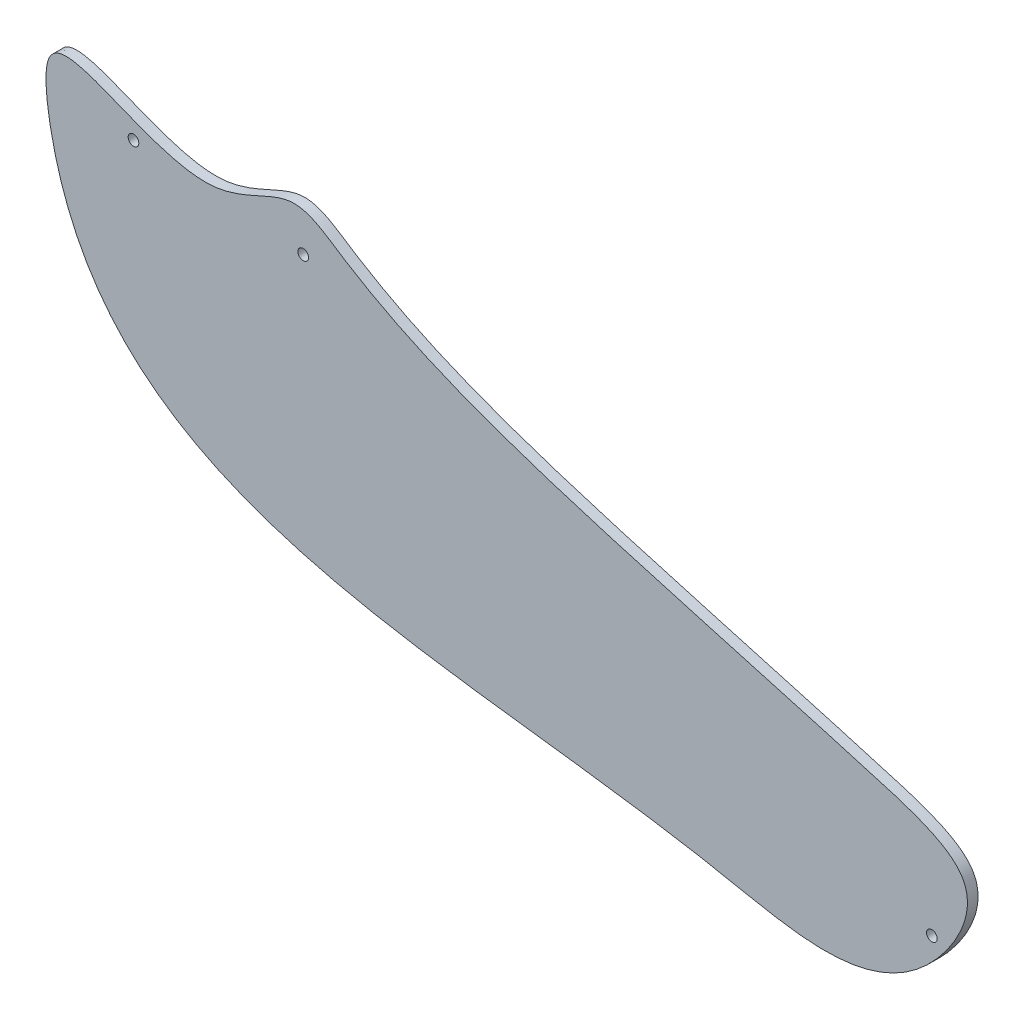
ISO-10303-21;
HEADER;
FILE_DESCRIPTION(('STEP AP214'),'2;1');
FILE_NAME('part.step','',(''),(''),'','','');
FILE_SCHEMA(('AUTOMOTIVE_DESIGN { 1 0 10303 214 1 1 1 1 }'));
ENDSEC;
DATA;
#1=APPLICATION_CONTEXT('core data for automotive mechanical design processes');
#2=APPLICATION_PROTOCOL_DEFINITION('international standard','automotive_design',2000,#1);
#3=PRODUCT_CONTEXT('',#1,'mechanical');
#4=PRODUCT('Part','Part','',(#3));
#5=PRODUCT_RELATED_PRODUCT_CATEGORY('part','',(#4));
#6=PRODUCT_DEFINITION_FORMATION('','',#4);
#7=PRODUCT_DEFINITION_CONTEXT('part definition',#1,'design');
#8=PRODUCT_DEFINITION('design','',#6,#7);
#9=PRODUCT_DEFINITION_SHAPE('','',#8);
#10=(LENGTH_UNIT() NAMED_UNIT(*) SI_UNIT(.MILLI.,.METRE.));
#11=(NAMED_UNIT(*) PLANE_ANGLE_UNIT() SI_UNIT($,.RADIAN.));
#12=(NAMED_UNIT(*) SI_UNIT($,.STERADIAN.) SOLID_ANGLE_UNIT());
#13=UNCERTAINTY_MEASURE_WITH_UNIT(LENGTH_MEASURE(1.E-05),#10,'distance_accuracy_value','');
#14=(GEOMETRIC_REPRESENTATION_CONTEXT(3) GLOBAL_UNCERTAINTY_ASSIGNED_CONTEXT((#13)) GLOBAL_UNIT_ASSIGNED_CONTEXT((#10,
#11,#12)) REPRESENTATION_CONTEXT('',''));
#15=CARTESIAN_POINT('',(0.,0.,0.));
#16=DIRECTION('',(0.,0.,1.));
#17=DIRECTION('',(1.,0.,0.));
#18=AXIS2_PLACEMENT_3D('',#15,#16,#17);
#19=CARTESIAN_POINT('',(134.791463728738,-82.0310408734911,3.175));
#20=DIRECTION('',(0.,0.,-1.));
#21=DIRECTION('',(-1.,0.,0.));
#22=AXIS2_PLACEMENT_3D('',#19,#20,#21);
#23=PLANE('',#22);
#24=CARTESIAN_POINT('',(18.7641264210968,25.089369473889,3.175));
#25=CARTESIAN_POINT('',(12.5561933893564,24.3583087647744,3.175));
#26=CARTESIAN_POINT('',(-10.8316301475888,5.94408983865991,3.175));
#27=CARTESIAN_POINT('',(-56.9541561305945,43.8578616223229,3.175));
#28=CARTESIAN_POINT('',(-44.1969909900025,-77.6319662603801,3.175));
#29=CARTESIAN_POINT('',(75.0878275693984,-66.7365969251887,3.175));
#30=CARTESIAN_POINT('',(180.498147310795,-91.7160799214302,3.175));
#31=CARTESIAN_POINT('',(209.476398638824,-83.2544465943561,3.175));
#32=CARTESIAN_POINT('',(229.594936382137,-47.0322501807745,3.175));
#33=CARTESIAN_POINT('',(119.922258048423,-14.520847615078,3.175));
#34=CARTESIAN_POINT('',(63.0522011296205,-2.59904895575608,3.175));
#35=CARTESIAN_POINT('',(24.0525082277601,25.7121416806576,3.175));
#36=CARTESIAN_POINT('',(18.7641264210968,25.089369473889,3.175));
#37=B_SPLINE_CURVE_WITH_KNOTS('',3,(#24,#25,#26,#27,#28,#29,#30,#31,#32,#33,#34,#35,#36),
.UNSPECIFIED.,.T.,.F.,(4,1,1,1,1,1,1,1,1,1,4),(0.,0.0389716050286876,0.121139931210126,
0.151271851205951,0.516777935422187,0.563687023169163,0.620362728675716,0.663245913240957,
0.701209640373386,0.966801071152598,0.999999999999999),.UNSPECIFIED.);
#38=CARTESIAN_POINT('',(18.7641264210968,25.089369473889,3.175));
#39=VERTEX_POINT('',#38);
#40=EDGE_CURVE('E10',#39,#39,#37,.T.);
#41=ORIENTED_EDGE('',*,*,#40,.T.);
#42=EDGE_LOOP('',(#41));
#43=FACE_BOUND('',#42,.T.);
#44=CARTESIAN_POINT('',(22.8333906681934,13.3021208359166,3.175));
#45=DIRECTION('',(0.,0.,1.));
#46=DIRECTION('',(1.,0.,0.));
#47=AXIS2_PLACEMENT_3D('',#44,#45,#46);
#48=CIRCLE('',#47,1.5875);
#49=CARTESIAN_POINT('',(24.4208906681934,13.3021208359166,3.175));
#50=VERTEX_POINT('',#49);
#51=EDGE_CURVE('E52',#50,#50,#48,.T.);
#52=ORIENTED_EDGE('',*,*,#51,.F.);
#53=EDGE_LOOP('',(#52));
#54=FACE_BOUND('',#53,.T.);
#55=CARTESIAN_POINT('',(-27.8498988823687,17.5584243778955,3.175));
#56=DIRECTION('',(0.,0.,1.));
#57=DIRECTION('',(1.,0.,0.));
#58=AXIS2_PLACEMENT_3D('',#55,#56,#57);
#59=CIRCLE('',#58,1.5875);
#60=CARTESIAN_POINT('',(-26.2623988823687,17.5584243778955,3.175));
#61=VERTEX_POINT('',#60);
#62=EDGE_CURVE('E64',#61,#61,#59,.T.);
#63=ORIENTED_EDGE('',*,*,#62,.F.);
#64=EDGE_LOOP('',(#63));
#65=FACE_BOUND('',#64,.T.);
#66=CARTESIAN_POINT('',(210.541872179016,-68.9714382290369,3.175));
#67=DIRECTION('',(0.,0.,1.));
#68=DIRECTION('',(1.,0.,0.));
#69=AXIS2_PLACEMENT_3D('',#66,#67,#68);
#70=CIRCLE('',#69,1.58749999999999);
#71=CARTESIAN_POINT('',(212.129372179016,-68.9714382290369,3.175));
#72=VERTEX_POINT('',#71);
#73=EDGE_CURVE('E72',#72,#72,#70,.T.);
#74=ORIENTED_EDGE('',*,*,#73,.F.);
#75=EDGE_LOOP('',(#74));
#76=FACE_BOUND('',#75,.T.);
#77=ADVANCED_FACE('F37',(#43,#54,#65,#76),#23,.F.);
#78=CARTESIAN_POINT('',(134.791463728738,-82.0310408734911,0.));
#79=DIRECTION('',(0.,0.,-1.));
#80=DIRECTION('',(-1.,0.,0.));
#81=AXIS2_PLACEMENT_3D('',#78,#79,#80);
#82=PLANE('',#81);
#83=CARTESIAN_POINT('',(-27.8498988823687,17.5584243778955,0.));
#84=DIRECTION('',(0.,0.,1.));
#85=DIRECTION('',(1.,0.,0.));
#86=AXIS2_PLACEMENT_3D('',#83,#84,#85);
#87=CIRCLE('',#86,1.5875);
#88=CARTESIAN_POINT('',(-26.2623988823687,17.5584243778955,0.));
#89=VERTEX_POINT('',#88);
#90=EDGE_CURVE('E68',#89,#89,#87,.T.);
#91=ORIENTED_EDGE('',*,*,#90,.T.);
#92=EDGE_LOOP('',(#91));
#93=FACE_BOUND('',#92,.T.);
#94=CARTESIAN_POINT('',(18.7641264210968,25.089369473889,0.));
#95=CARTESIAN_POINT('',(12.5561933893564,24.3583087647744,0.));
#96=CARTESIAN_POINT('',(-10.8316301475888,5.94408983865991,0.));
#97=CARTESIAN_POINT('',(-56.9541561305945,43.8578616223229,0.));
#98=CARTESIAN_POINT('',(-44.1969909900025,-77.6319662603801,0.));
#99=CARTESIAN_POINT('',(75.0878275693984,-66.7365969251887,0.));
#100=CARTESIAN_POINT('',(180.498147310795,-91.7160799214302,0.));
#101=CARTESIAN_POINT('',(209.476398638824,-83.2544465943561,0.));
#102=CARTESIAN_POINT('',(229.594936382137,-47.0322501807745,0.));
#103=CARTESIAN_POINT('',(119.922258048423,-14.520847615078,0.));
#104=CARTESIAN_POINT('',(63.0522011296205,-2.59904895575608,0.));
#105=CARTESIAN_POINT('',(24.0525082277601,25.7121416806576,0.));
#106=CARTESIAN_POINT('',(18.7641264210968,25.089369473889,0.));
#107=B_SPLINE_CURVE_WITH_KNOTS('',3,(#94,#95,#96,#97,#98,#99,#100,#101,#102,#103,#104,#105,
#106),.UNSPECIFIED.,.T.,.F.,(4,1,1,1,1,1,1,1,1,1,4),(0.,0.0389716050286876,0.121139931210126,
0.151271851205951,0.516777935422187,0.563687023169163,0.620362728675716,0.663245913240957,
0.701209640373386,0.966801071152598,0.999999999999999),.UNSPECIFIED.);
#108=CARTESIAN_POINT('',(18.7641264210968,25.089369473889,0.));
#109=VERTEX_POINT('',#108);
#110=EDGE_CURVE('E42',#109,#109,#107,.T.);
#111=ORIENTED_EDGE('',*,*,#110,.F.);
#112=EDGE_LOOP('',(#111));
#113=FACE_BOUND('',#112,.T.);
#114=CARTESIAN_POINT('',(22.8333906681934,13.3021208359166,0.));
#115=DIRECTION('',(0.,0.,1.));
#116=DIRECTION('',(1.,0.,0.));
#117=AXIS2_PLACEMENT_3D('',#114,#115,#116);
#118=CIRCLE('',#117,1.5875);
#119=CARTESIAN_POINT('',(24.4208906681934,13.3021208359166,0.));
#120=VERTEX_POINT('',#119);
#121=EDGE_CURVE('E57',#120,#120,#118,.T.);
#122=ORIENTED_EDGE('',*,*,#121,.T.);
#123=EDGE_LOOP('',(#122));
#124=FACE_BOUND('',#123,.T.);
#125=CARTESIAN_POINT('',(210.541872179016,-68.9714382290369,0.));
#126=DIRECTION('',(0.,0.,1.));
#127=DIRECTION('',(1.,0.,0.));
#128=AXIS2_PLACEMENT_3D('',#125,#126,#127);
#129=CIRCLE('',#128,1.58749999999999);
#130=CARTESIAN_POINT('',(212.129372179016,-68.9714382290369,0.));
#131=VERTEX_POINT('',#130);
#132=EDGE_CURVE('E76',#131,#131,#129,.T.);
#133=ORIENTED_EDGE('',*,*,#132,.T.);
#134=EDGE_LOOP('',(#133));
#135=FACE_BOUND('',#134,.T.);
#136=ADVANCED_FACE('F88',(#93,#113,#124,#135),#82,.T.);
#137=DIRECTION('',(0.,0.,-1.));
#138=VECTOR('',#137,1.);
#139=SURFACE_OF_LINEAR_EXTRUSION('',#37,#138);
#140=ORIENTED_EDGE('',*,*,#40,.F.);
#141=EDGE_LOOP('',(#140));
#142=FACE_BOUND('',#141,.T.);
#143=ORIENTED_EDGE('',*,*,#110,.T.);
#144=EDGE_LOOP('',(#143));
#145=FACE_BOUND('',#144,.T.);
#146=ADVANCED_FACE('F39',(#142,#145),#139,.F.);
#147=CARTESIAN_POINT('',(22.8333906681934,13.3021208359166,3.175));
#148=DIRECTION('',(0.,0.,-1.));
#149=DIRECTION('',(-1.,0.,0.));
#150=AXIS2_PLACEMENT_3D('',#147,#148,#149);
#151=CYLINDRICAL_SURFACE('',#150,1.5875);
#152=ORIENTED_EDGE('',*,*,#51,.T.);
#153=EDGE_LOOP('',(#152));
#154=FACE_BOUND('',#153,.T.);
#155=ORIENTED_EDGE('',*,*,#121,.F.);
#156=EDGE_LOOP('',(#155));
#157=FACE_BOUND('',#156,.T.);
#158=ADVANCED_FACE('F96',(#154,#157),#151,.F.);
#159=CARTESIAN_POINT('',(-27.8498988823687,17.5584243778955,3.175));
#160=DIRECTION('',(0.,0.,-1.));
#161=DIRECTION('',(-1.,0.,0.));
#162=AXIS2_PLACEMENT_3D('',#159,#160,#161);
#163=CYLINDRICAL_SURFACE('',#162,1.5875);
#164=ORIENTED_EDGE('',*,*,#62,.T.);
#165=EDGE_LOOP('',(#164));
#166=FACE_BOUND('',#165,.T.);
#167=ORIENTED_EDGE('',*,*,#90,.F.);
#168=EDGE_LOOP('',(#167));
#169=FACE_BOUND('',#168,.T.);
#170=ADVANCED_FACE('F99',(#166,#169),#163,.F.);
#171=CARTESIAN_POINT('',(210.541872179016,-68.9714382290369,3.175));
#172=DIRECTION('',(0.,0.,-1.));
#173=DIRECTION('',(-1.,0.,0.));
#174=AXIS2_PLACEMENT_3D('',#171,#172,#173);
#175=CYLINDRICAL_SURFACE('',#174,1.58749999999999);
#176=ORIENTED_EDGE('',*,*,#73,.T.);
#177=EDGE_LOOP('',(#176));
#178=FACE_BOUND('',#177,.T.);
#179=ORIENTED_EDGE('',*,*,#132,.F.);
#180=EDGE_LOOP('',(#179));
#181=FACE_BOUND('',#180,.T.);
#182=ADVANCED_FACE('F84',(#178,#181),#175,.F.);
#183=CLOSED_SHELL('',(#77,#136,#146,#158,#170,#182));
#184=MANIFOLD_SOLID_BREP('B2',#183);
#185=ADVANCED_BREP_SHAPE_REPRESENTATION('',(#18,#184),#14);
#186=SHAPE_DEFINITION_REPRESENTATION(#9,#185);
ENDSEC;
END-ISO-10303-21;
